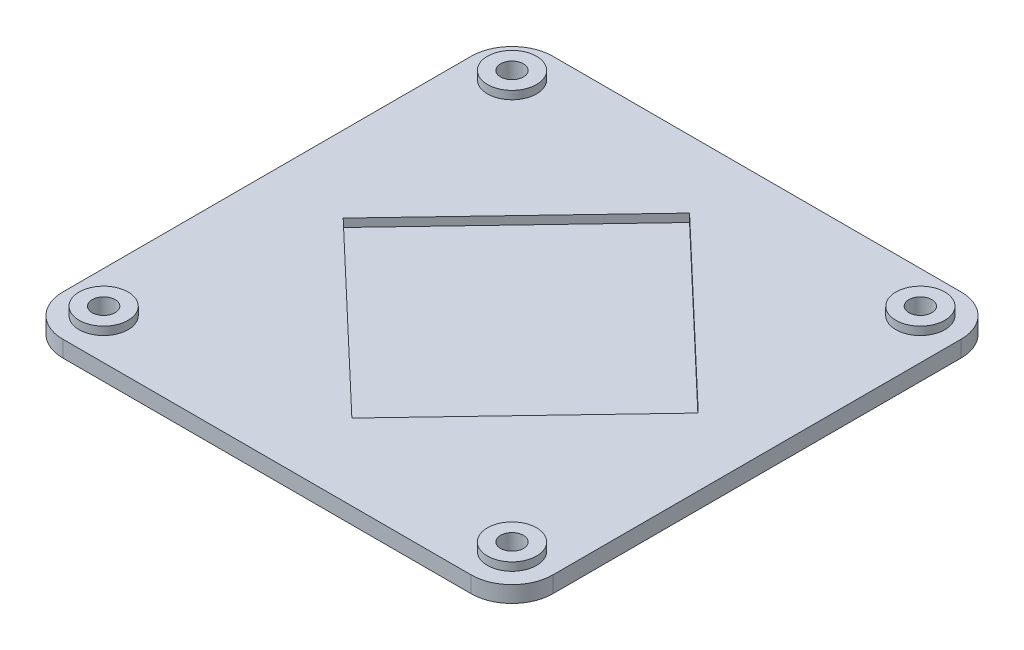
from build123d import *

# Parameters (mm, degrees)
SKETCH_1_W          = 60
SKETCH_1_H          = 60
EXTRUDE_1_DEPTH     = 2
FILLET_1_R          = 5
SKETCH_2_R          = 3
EXTRUDE_2_DEPTH     = 1
SKETCH_3_R          = 1.4
CUT_EXTRUDE_1_DEPTH = 6
CUT_EXTRUDE_3_DEPTH = 1


with BuildPart() as part:
    # Sketch 1 → Extrude 1 (new body)
    with BuildSketch(Plane(origin=(0, 0, 0), x_dir=(1, 0, 0), z_dir=(0, 1, 0))):
        Rectangle(SKETCH_1_W, SKETCH_1_H)
    extrude(amount=EXTRUDE_1_DEPTH)

    # Fillet 1
    fillet_1_edges = [part.edges().sort_by_distance(p)[0] for p in [
        (30, 1, 30),
        (-30, 1, 30),
        (-30, 1, -30),
        (30, 1, -30),
    ]]
    fillet(fillet_1_edges, radius=FILLET_1_R)

    # Sketch 2 → Extrude 2 (add)
    with BuildSketch(Plane(origin=(0, 2, 0), x_dir=(1, 0, 0), z_dir=(0, 1, 0))):
        with Locations(Location((-25, 25, 0), (0, 0, 270))):
            Circle(SKETCH_2_R)
        with Locations(Location((25, 25, 0), (0, 0, 270))):
            Circle(SKETCH_2_R)
        with Locations(Location((25, -25, 0), (0, 0, 270))):
            Circle(SKETCH_2_R)
        with Locations(Location((-25, -25, 0), (0, 0, 270))):
            Circle(SKETCH_2_R)
    extrude(amount=EXTRUDE_2_DEPTH)

    # Sketch 3 → Cut-Extrude 1 (cut)
    with BuildSketch(Plane(origin=(0, 3, 0), x_dir=(1, 0, 0), z_dir=(0, 1, 0))):
        with Locations(Location((-25, 25, 0), (0, 0, 270))):
            Circle(SKETCH_3_R)
        with Locations(Location((25, 25, 0), (0, 0, 270))):
            Circle(SKETCH_3_R)
        with Locations(Location((25, -25, 0), (0, 0, 270))):
            Circle(SKETCH_3_R)
        with Locations(Location((-25, -25, 0), (0, 0, 270))):
            Circle(SKETCH_3_R)
    extrude(amount=-CUT_EXTRUDE_1_DEPTH, mode=Mode.SUBTRACT)

    # Sketch 6 → Cut-Extrude 3 (cut)
    with BuildSketch(Plane(origin=(0, 2, 0), x_dir=(1, 0, 0), z_dir=(0, 1, 0))):
        Polygon((0, 21.739412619), (21.739412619, 1.065807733), (1.065807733, -20.673604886), (-20.673604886, 0), align=None)
    extrude(amount=-CUT_EXTRUDE_3_DEPTH, mode=Mode.SUBTRACT)


solid = part.part
